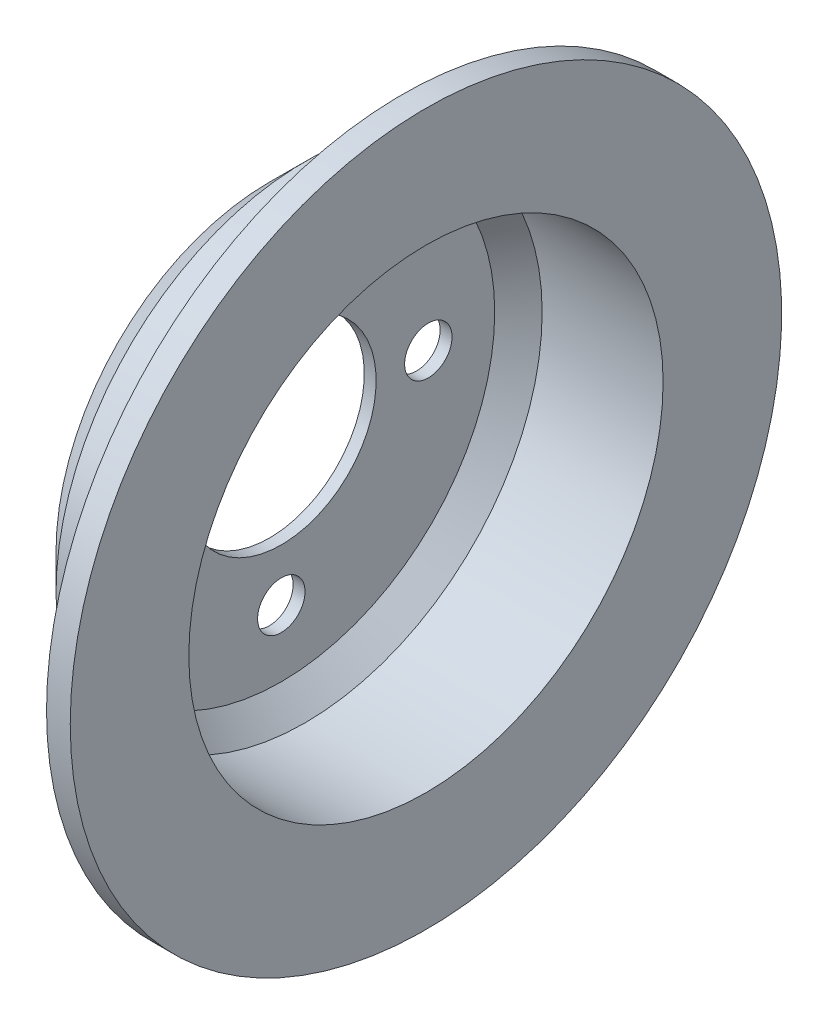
from build123d import *

# Parameters (mm, degrees)
F_20_0_20_DIAMETER_HOLE1_D = 20


with BuildPart() as part:
    # Sketch1 → Revolve1 (revolve)
    with BuildSketch(Plane.XY, mode=Mode.PRIVATE) as revolve1_sk:
        Polygon((0, 40), (5, 40), (5, 90), (15, 100), (66, 100), (66, 150), (56, 150), (56, 110), (61, 110), (61, 105), (15, 105), (0, 90), align=None)
    revolve(revolve1_sk.sketch.rotate(Axis((0, 0, 0), (1, 0, 0)), 90), axis=Axis((0, 0, 0), (1, 0, 0)))

    # 20.0 _20_ Diameter Hole1 (through all)
    with Locations(Plane(origin=(5, 0, 0), x_dir=(0, 0, -1), z_dir=(1, 0, 0))):
        with Locations((0, 62), (62, 0), (-62, 0), (0, -62)):
            Hole(F_20_0_20_DIAMETER_HOLE1_D / 2)


solid = part.part
